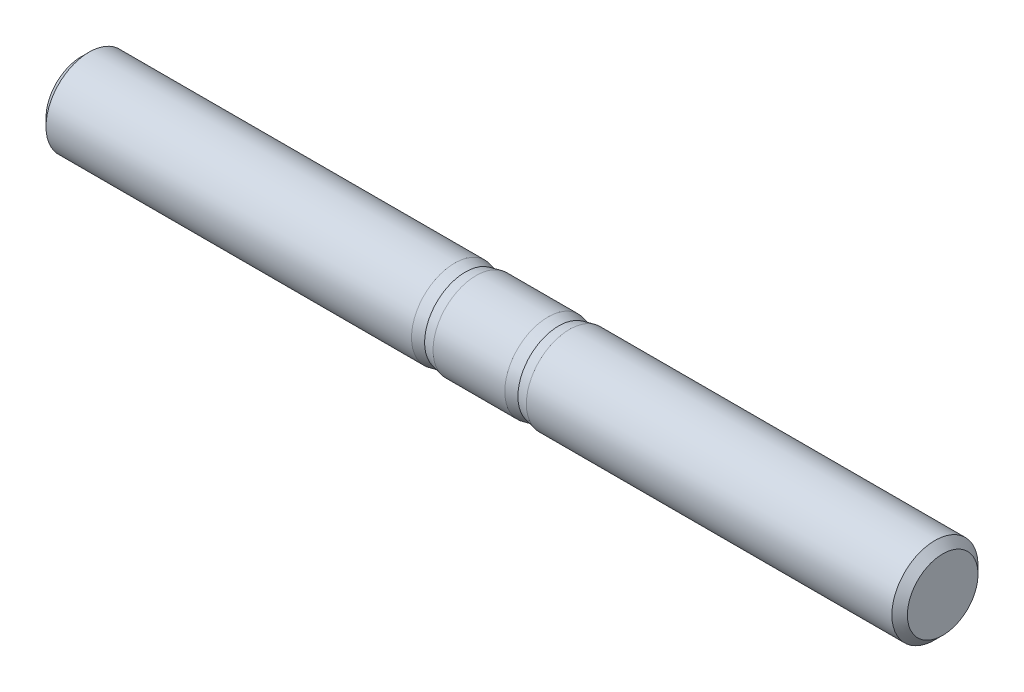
ISO-10303-21;
HEADER;
FILE_DESCRIPTION(('STEP AP214'),'2;1');
FILE_NAME('part.step','',(''),(''),'','','');
FILE_SCHEMA(('AUTOMOTIVE_DESIGN { 1 0 10303 214 1 1 1 1 }'));
ENDSEC;
DATA;
#1=APPLICATION_CONTEXT('core data for automotive mechanical design processes');
#2=APPLICATION_PROTOCOL_DEFINITION('international standard','automotive_design',2000,#1);
#3=PRODUCT_CONTEXT('',#1,'mechanical');
#4=PRODUCT('Part','Part','',(#3));
#5=PRODUCT_RELATED_PRODUCT_CATEGORY('part','',(#4));
#6=PRODUCT_DEFINITION_FORMATION('','',#4);
#7=PRODUCT_DEFINITION_CONTEXT('part definition',#1,'design');
#8=PRODUCT_DEFINITION('design','',#6,#7);
#9=PRODUCT_DEFINITION_SHAPE('','',#8);
#10=(LENGTH_UNIT() NAMED_UNIT(*) SI_UNIT(.MILLI.,.METRE.));
#11=(NAMED_UNIT(*) PLANE_ANGLE_UNIT() SI_UNIT($,.RADIAN.));
#12=(NAMED_UNIT(*) SI_UNIT($,.STERADIAN.) SOLID_ANGLE_UNIT());
#13=UNCERTAINTY_MEASURE_WITH_UNIT(LENGTH_MEASURE(1.E-05),#10,'distance_accuracy_value','');
#14=(GEOMETRIC_REPRESENTATION_CONTEXT(3) GLOBAL_UNCERTAINTY_ASSIGNED_CONTEXT((#13)) GLOBAL_UNIT_ASSIGNED_CONTEXT((#10,
#11,#12)) REPRESENTATION_CONTEXT('',''));
#15=CARTESIAN_POINT('',(0.,0.,0.));
#16=DIRECTION('',(0.,0.,1.));
#17=DIRECTION('',(1.,0.,0.));
#18=AXIS2_PLACEMENT_3D('',#15,#16,#17);
#19=CARTESIAN_POINT('',(13.75,0.,0.));
#20=DIRECTION('',(-1.,0.,0.));
#21=DIRECTION('',(0.,0.,1.));
#22=AXIS2_PLACEMENT_3D('',#19,#20,#21);
#23=CONICAL_SURFACE('',#22,1.3375,0.213368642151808);
#24=CARTESIAN_POINT('',(13.,0.,0.));
#25=DIRECTION('',(-1.,0.,0.));
#26=DIRECTION('',(0.,0.,1.));
#27=AXIS2_PLACEMENT_3D('',#24,#25,#26);
#28=CIRCLE('',#27,1.5);
#29=CARTESIAN_POINT('',(13.,0.,1.5));
#30=VERTEX_POINT('',#29);
#31=EDGE_CURVE('E59',#30,#30,#28,.T.);
#32=ORIENTED_EDGE('',*,*,#31,.F.);
#33=EDGE_LOOP('',(#32));
#34=FACE_BOUND('',#33,.T.);
#35=CARTESIAN_POINT('',(13.375,0.,0.));
#36=DIRECTION('',(1.,0.,0.));
#37=DIRECTION('',(0.,0.,-1.));
#38=AXIS2_PLACEMENT_3D('',#35,#36,#37);
#39=CIRCLE('',#38,1.41875);
#40=CARTESIAN_POINT('',(13.375,0.,-1.41875));
#41=VERTEX_POINT('',#40);
#42=EDGE_CURVE('E10',#41,#41,#39,.T.);
#43=ORIENTED_EDGE('',*,*,#42,.F.);
#44=EDGE_LOOP('',(#43));
#45=FACE_BOUND('',#44,.T.);
#46=ADVANCED_FACE('F33',(#34,#45),#23,.T.);
#47=CARTESIAN_POINT('',(0.,0.,0.));
#48=DIRECTION('',(1.,0.,0.));
#49=DIRECTION('',(0.,0.,-1.));
#50=AXIS2_PLACEMENT_3D('',#47,#48,#49);
#51=PLANE('',#50);
#52=CARTESIAN_POINT('',(0.,0.,0.));
#53=DIRECTION('',(1.,0.,0.));
#54=DIRECTION('',(0.,0.,-1.));
#55=AXIS2_PLACEMENT_3D('',#52,#53,#54);
#56=CIRCLE('',#55,1.2295);
#57=CARTESIAN_POINT('',(0.,0.,-1.2295));
#58=VERTEX_POINT('',#57);
#59=EDGE_CURVE('E56',#58,#58,#56,.F.);
#60=ORIENTED_EDGE('',*,*,#59,.T.);
#61=EDGE_LOOP('',(#60));
#62=FACE_BOUND('',#61,.T.);
#63=ADVANCED_FACE('F89',(#62),#51,.F.);
#64=CARTESIAN_POINT('',(-1.31084166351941,0.,0.));
#65=DIRECTION('',(-1.,0.,0.));
#66=DIRECTION('',(0.,0.,1.));
#67=AXIS2_PLACEMENT_3D('',#64,#65,#66);
#68=CYLINDRICAL_SURFACE('',#67,1.5);
#69=CARTESIAN_POINT('',(0.270499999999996,0.,0.));
#70=DIRECTION('',(1.,0.,0.));
#71=DIRECTION('',(0.,0.,-1.));
#72=AXIS2_PLACEMENT_3D('',#69,#70,#71);
#73=CIRCLE('',#72,1.5);
#74=CARTESIAN_POINT('',(0.270499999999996,0.,-1.5));
#75=VERTEX_POINT('',#74);
#76=EDGE_CURVE('E53',#75,#75,#73,.T.);
#77=ORIENTED_EDGE('',*,*,#76,.T.);
#78=EDGE_LOOP('',(#77));
#79=FACE_BOUND('',#78,.T.);
#80=ORIENTED_EDGE('',*,*,#31,.T.);
#81=EDGE_LOOP('',(#80));
#82=FACE_BOUND('',#81,.T.);
#83=ADVANCED_FACE('F95',(#79,#82),#68,.T.);
#84=CARTESIAN_POINT('',(0.,0.,0.));
#85=DIRECTION('',(1.,0.,0.));
#86=DIRECTION('',(0.,0.,-1.));
#87=AXIS2_PLACEMENT_3D('',#84,#85,#86);
#88=CONICAL_SURFACE('',#87,1.2295,0.785398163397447);
#89=ORIENTED_EDGE('',*,*,#76,.F.);
#90=EDGE_LOOP('',(#89));
#91=FACE_BOUND('',#90,.T.);
#92=ORIENTED_EDGE('',*,*,#59,.F.);
#93=EDGE_LOOP('',(#92));
#94=FACE_BOUND('',#93,.T.);
#95=ADVANCED_FACE('F85',(#91,#94),#88,.T.);
#96=CARTESIAN_POINT('',(13.75,0.,0.));
#97=DIRECTION('',(1.,0.,0.));
#98=DIRECTION('',(0.,0.,-1.));
#99=AXIS2_PLACEMENT_3D('',#96,#97,#98);
#100=CONICAL_SURFACE('',#99,1.5,0.213368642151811);
#101=CARTESIAN_POINT('',(13.75,0.,0.));
#102=DIRECTION('',(-1.,0.,0.));
#103=DIRECTION('',(0.,0.,1.));
#104=AXIS2_PLACEMENT_3D('',#101,#102,#103);
#105=CIRCLE('',#104,1.5);
#106=CARTESIAN_POINT('',(13.75,0.,1.5));
#107=VERTEX_POINT('',#106);
#108=EDGE_CURVE('E65',#107,#107,#105,.T.);
#109=ORIENTED_EDGE('',*,*,#108,.T.);
#110=EDGE_LOOP('',(#109));
#111=FACE_BOUND('',#110,.T.);
#112=ORIENTED_EDGE('',*,*,#42,.T.);
#113=EDGE_LOOP('',(#112));
#114=FACE_BOUND('',#113,.T.);
#115=ADVANCED_FACE('F76',(#111,#114),#100,.T.);
#116=CARTESIAN_POINT('',(17.,0.,0.));
#117=DIRECTION('',(-1.,0.,0.));
#118=DIRECTION('',(0.,0.,1.));
#119=AXIS2_PLACEMENT_3D('',#116,#117,#118);
#120=CONICAL_SURFACE('',#119,1.3375,0.213368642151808);
#121=CARTESIAN_POINT('',(16.25,0.,0.));
#122=DIRECTION('',(-1.,0.,0.));
#123=DIRECTION('',(0.,0.,1.));
#124=AXIS2_PLACEMENT_3D('',#121,#122,#123);
#125=CIRCLE('',#124,1.5);
#126=CARTESIAN_POINT('',(16.25,0.,1.5));
#127=VERTEX_POINT('',#126);
#128=EDGE_CURVE('E68',#127,#127,#125,.T.);
#129=ORIENTED_EDGE('',*,*,#128,.F.);
#130=EDGE_LOOP('',(#129));
#131=FACE_BOUND('',#130,.T.);
#132=CARTESIAN_POINT('',(16.625,0.,0.));
#133=DIRECTION('',(-1.,0.,0.));
#134=DIRECTION('',(0.,0.,1.));
#135=AXIS2_PLACEMENT_3D('',#132,#133,#134);
#136=CIRCLE('',#135,1.41875);
#137=CARTESIAN_POINT('',(16.625,0.,1.41875));
#138=VERTEX_POINT('',#137);
#139=EDGE_CURVE('E40',#138,#138,#136,.T.);
#140=ORIENTED_EDGE('',*,*,#139,.T.);
#141=EDGE_LOOP('',(#140));
#142=FACE_BOUND('',#141,.T.);
#143=ADVANCED_FACE('F74',(#131,#142),#120,.T.);
#144=CARTESIAN_POINT('',(-7.80908694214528,0.,0.));
#145=DIRECTION('',(-1.,0.,0.));
#146=DIRECTION('',(0.,0.,1.));
#147=AXIS2_PLACEMENT_3D('',#144,#145,#146);
#148=CYLINDRICAL_SURFACE('',#147,1.5);
#149=ORIENTED_EDGE('',*,*,#108,.F.);
#150=EDGE_LOOP('',(#149));
#151=FACE_BOUND('',#150,.T.);
#152=ORIENTED_EDGE('',*,*,#128,.T.);
#153=EDGE_LOOP('',(#152));
#154=FACE_BOUND('',#153,.T.);
#155=ADVANCED_FACE('F72',(#151,#154),#148,.T.);
#156=CARTESIAN_POINT('',(30.,1.5,0.));
#157=DIRECTION('',(-1.,0.,0.));
#158=DIRECTION('',(0.,0.,1.));
#159=AXIS2_PLACEMENT_3D('',#156,#157,#158);
#160=PLANE('',#159);
#161=CARTESIAN_POINT('',(30.,0.,0.));
#162=DIRECTION('',(-1.,0.,0.));
#163=DIRECTION('',(0.,0.,1.));
#164=AXIS2_PLACEMENT_3D('',#161,#162,#163);
#165=CIRCLE('',#164,1.2295);
#166=CARTESIAN_POINT('',(30.,0.,1.2295));
#167=VERTEX_POINT('',#166);
#168=EDGE_CURVE('E44',#167,#167,#165,.F.);
#169=ORIENTED_EDGE('',*,*,#168,.T.);
#170=EDGE_LOOP('',(#169));
#171=FACE_BOUND('',#170,.T.);
#172=ADVANCED_FACE('F82',(#171),#160,.F.);
#173=CARTESIAN_POINT('',(29.7295,0.,0.));
#174=DIRECTION('',(-1.,0.,0.));
#175=DIRECTION('',(0.,0.,1.));
#176=AXIS2_PLACEMENT_3D('',#173,#174,#175);
#177=CONICAL_SURFACE('',#176,1.5,0.785398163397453);
#178=CARTESIAN_POINT('',(29.7295,0.,0.));
#179=DIRECTION('',(-1.,0.,0.));
#180=DIRECTION('',(0.,0.,1.));
#181=AXIS2_PLACEMENT_3D('',#178,#179,#180);
#182=CIRCLE('',#181,1.5);
#183=CARTESIAN_POINT('',(29.7295,0.,1.5));
#184=VERTEX_POINT('',#183);
#185=EDGE_CURVE('E48',#184,#184,#182,.T.);
#186=CARTESIAN_POINT('',(30.,0.,1.2295));
#187=CARTESIAN_POINT('',(29.9971822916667,0.,1.23231770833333));
#188=CARTESIAN_POINT('',(29.9943645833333,0.,1.23513541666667));
#189=CARTESIAN_POINT('',(29.9887291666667,0.,1.24077083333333));
#190=CARTESIAN_POINT('',(29.9859114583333,0.,1.24358854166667));
#191=CARTESIAN_POINT('',(29.9802760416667,0.,1.24922395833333));
#192=CARTESIAN_POINT('',(29.9774583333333,0.,1.25204166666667));
#193=CARTESIAN_POINT('',(29.9718229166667,0.,1.25767708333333));
#194=CARTESIAN_POINT('',(29.9690052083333,0.,1.26049479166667));
#195=CARTESIAN_POINT('',(29.9633697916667,0.,1.26613020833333));
#196=CARTESIAN_POINT('',(29.9605520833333,0.,1.26894791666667));
#197=CARTESIAN_POINT('',(29.9549166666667,0.,1.27458333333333));
#198=CARTESIAN_POINT('',(29.9520989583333,0.,1.27740104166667));
#199=CARTESIAN_POINT('',(29.9464635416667,0.,1.28303645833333));
#200=CARTESIAN_POINT('',(29.9436458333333,0.,1.28585416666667));
#201=CARTESIAN_POINT('',(29.9380104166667,0.,1.29148958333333));
#202=CARTESIAN_POINT('',(29.9351927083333,0.,1.29430729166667));
#203=CARTESIAN_POINT('',(29.9295572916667,0.,1.29994270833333));
#204=CARTESIAN_POINT('',(29.9267395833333,0.,1.30276041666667));
#205=CARTESIAN_POINT('',(29.9211041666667,0.,1.30839583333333));
#206=CARTESIAN_POINT('',(29.9182864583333,0.,1.31121354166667));
#207=CARTESIAN_POINT('',(29.9126510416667,0.,1.31684895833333));
#208=CARTESIAN_POINT('',(29.9098333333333,0.,1.31966666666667));
#209=CARTESIAN_POINT('',(29.9041979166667,0.,1.32530208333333));
#210=CARTESIAN_POINT('',(29.9013802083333,0.,1.32811979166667));
#211=CARTESIAN_POINT('',(29.8957447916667,0.,1.33375520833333));
#212=CARTESIAN_POINT('',(29.8929270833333,0.,1.33657291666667));
#213=CARTESIAN_POINT('',(29.8872916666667,0.,1.34220833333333));
#214=CARTESIAN_POINT('',(29.8844739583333,0.,1.34502604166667));
#215=CARTESIAN_POINT('',(29.8788385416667,0.,1.35066145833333));
#216=CARTESIAN_POINT('',(29.8760208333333,0.,1.35347916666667));
#217=CARTESIAN_POINT('',(29.8703854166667,0.,1.35911458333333));
#218=CARTESIAN_POINT('',(29.8675677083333,0.,1.36193229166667));
#219=CARTESIAN_POINT('',(29.8619322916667,0.,1.36756770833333));
#220=CARTESIAN_POINT('',(29.8591145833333,0.,1.37038541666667));
#221=CARTESIAN_POINT('',(29.8534791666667,0.,1.37602083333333));
#222=CARTESIAN_POINT('',(29.8506614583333,0.,1.37883854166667));
#223=CARTESIAN_POINT('',(29.8450260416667,0.,1.38447395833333));
#224=CARTESIAN_POINT('',(29.8422083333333,0.,1.38729166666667));
#225=CARTESIAN_POINT('',(29.8365729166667,0.,1.39292708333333));
#226=CARTESIAN_POINT('',(29.8337552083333,0.,1.39574479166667));
#227=CARTESIAN_POINT('',(29.8281197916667,0.,1.40138020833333));
#228=CARTESIAN_POINT('',(29.8253020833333,0.,1.40419791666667));
#229=CARTESIAN_POINT('',(29.8196666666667,0.,1.40983333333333));
#230=CARTESIAN_POINT('',(29.8168489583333,0.,1.41265104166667));
#231=CARTESIAN_POINT('',(29.8112135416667,0.,1.41828645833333));
#232=CARTESIAN_POINT('',(29.8083958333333,0.,1.42110416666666));
#233=CARTESIAN_POINT('',(29.8027604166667,0.,1.42673958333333));
#234=CARTESIAN_POINT('',(29.7999427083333,0.,1.42955729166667));
#235=CARTESIAN_POINT('',(29.7943072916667,0.,1.43519270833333));
#236=CARTESIAN_POINT('',(29.7914895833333,0.,1.43801041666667));
#237=CARTESIAN_POINT('',(29.7858541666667,0.,1.44364583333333));
#238=CARTESIAN_POINT('',(29.7830364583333,0.,1.44646354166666));
#239=CARTESIAN_POINT('',(29.7774010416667,0.,1.45209895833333));
#240=CARTESIAN_POINT('',(29.7745833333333,0.,1.45491666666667));
#241=CARTESIAN_POINT('',(29.7689479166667,0.,1.46055208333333));
#242=CARTESIAN_POINT('',(29.7661302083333,0.,1.46336979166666));
#243=CARTESIAN_POINT('',(29.7604947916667,0.,1.46900520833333));
#244=CARTESIAN_POINT('',(29.7576770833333,0.,1.47182291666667));
#245=CARTESIAN_POINT('',(29.7520416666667,0.,1.47745833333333));
#246=CARTESIAN_POINT('',(29.7492239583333,0.,1.48027604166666));
#247=CARTESIAN_POINT('',(29.7435885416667,0.,1.48591145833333));
#248=CARTESIAN_POINT('',(29.7407708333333,0.,1.48872916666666));
#249=CARTESIAN_POINT('',(29.7351354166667,0.,1.49436458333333));
#250=CARTESIAN_POINT('',(29.7323177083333,0.,1.49718229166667));
#251=CARTESIAN_POINT('',(29.7295,0.,1.5));
#252=B_SPLINE_CURVE_WITH_KNOTS('',3,(#186,#187,#188,#189,#190,#191,#192,#193,#194,#195,#196,
#197,#198,#199,#200,#201,#202,#203,#204,#205,#206,#207,#208,#209,#210,#211,#212,#213,#214,#215,
#216,#217,#218,#219,#220,#221,#222,#223,#224,#225,#226,#227,#228,#229,#230,#231,#232,#233,#234,
#235,#236,#237,#238,#239,#240,#241,#242,#243,#244,#245,#246,#247,#248,#249,#250,#251),
.UNSPECIFIED.,.F.,.F.,(4,2,2,2,2,2,2,2,2,2,2,2,2,2,2,2,2,2,2,2,2,2,2,2,2,2,2,2,2,2,2,2,4),(0.,
0.0119545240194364,0.0239090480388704,0.0358635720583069,0.0478180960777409,0.0597726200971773,
0.0717271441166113,0.0836816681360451,0.0956361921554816,0.107590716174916,0.119545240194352,
0.131499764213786,0.14345428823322,0.155408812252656,0.16736333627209,0.179317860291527,
0.191272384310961,0.203226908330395,0.215181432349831,0.227135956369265,0.239090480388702,
0.251045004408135,0.262999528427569,0.274954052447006,0.28690857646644,0.298863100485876,
0.31081762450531,0.322772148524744,0.334726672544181,0.346681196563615,0.358635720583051,
0.370590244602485,0.382544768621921),.UNSPECIFIED.);
#253=EDGE_CURVE('BSEAM35',#167,#184,#252,.T.);
#254=ORIENTED_EDGE('',*,*,#168,.F.);
#255=ORIENTED_EDGE('',*,*,#185,.F.);
#256=ORIENTED_EDGE('',*,*,#253,.T.);
#257=ORIENTED_EDGE('',*,*,#253,.F.);
#258=EDGE_LOOP('',(#254,#256,#255,#257));
#259=FACE_BOUND('',#258,.T.);
#260=ADVANCED_FACE('F35',(#259),#177,.T.);
#261=CARTESIAN_POINT('',(-1.31084166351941,0.,0.));
#262=DIRECTION('',(-1.,0.,0.));
#263=DIRECTION('',(0.,0.,1.));
#264=AXIS2_PLACEMENT_3D('',#261,#262,#263);
#265=CYLINDRICAL_SURFACE('',#264,1.5);
#266=ORIENTED_EDGE('',*,*,#185,.T.);
#267=EDGE_LOOP('',(#266));
#268=FACE_BOUND('',#267,.T.);
#269=CARTESIAN_POINT('',(17.,0.,0.));
#270=DIRECTION('',(-1.,0.,0.));
#271=DIRECTION('',(0.,0.,1.));
#272=AXIS2_PLACEMENT_3D('',#269,#270,#271);
#273=CIRCLE('',#272,1.5);
#274=CARTESIAN_POINT('',(17.,0.,1.5));
#275=VERTEX_POINT('',#274);
#276=EDGE_CURVE('E62',#275,#275,#273,.T.);
#277=ORIENTED_EDGE('',*,*,#276,.F.);
#278=EDGE_LOOP('',(#277));
#279=FACE_BOUND('',#278,.T.);
#280=ADVANCED_FACE('F143',(#268,#279),#265,.T.);
#281=CARTESIAN_POINT('',(17.,0.,0.));
#282=DIRECTION('',(1.,0.,0.));
#283=DIRECTION('',(0.,0.,-1.));
#284=AXIS2_PLACEMENT_3D('',#281,#282,#283);
#285=CONICAL_SURFACE('',#284,1.5,0.213368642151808);
#286=ORIENTED_EDGE('',*,*,#276,.T.);
#287=EDGE_LOOP('',(#286));
#288=FACE_BOUND('',#287,.T.);
#289=ORIENTED_EDGE('',*,*,#139,.F.);
#290=EDGE_LOOP('',(#289));
#291=FACE_BOUND('',#290,.T.);
#292=ADVANCED_FACE('F102',(#288,#291),#285,.T.);
#293=CLOSED_SHELL('',(#46,#63,#83,#95,#115,#143,#155,#172,#260,#280,#292));
#294=MANIFOLD_SOLID_BREP('B2',#293);
#295=ADVANCED_BREP_SHAPE_REPRESENTATION('',(#18,#294),#14);
#296=SHAPE_DEFINITION_REPRESENTATION(#9,#295);
ENDSEC;
END-ISO-10303-21;
